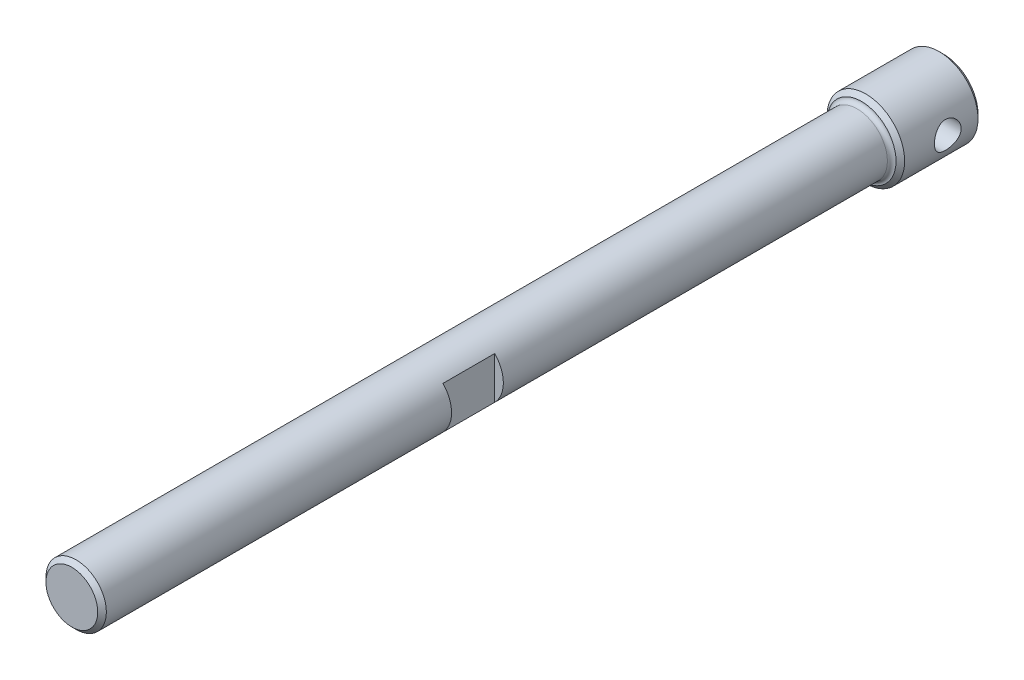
ISO-10303-21;
HEADER;
FILE_DESCRIPTION(('STEP AP214'),'2;1');
FILE_NAME('part.step','',(''),(''),'','','');
FILE_SCHEMA(('AUTOMOTIVE_DESIGN { 1 0 10303 214 1 1 1 1 }'));
ENDSEC;
DATA;
#1=APPLICATION_CONTEXT('core data for automotive mechanical design processes');
#2=APPLICATION_PROTOCOL_DEFINITION('international standard','automotive_design',2000,#1);
#3=PRODUCT_CONTEXT('',#1,'mechanical');
#4=PRODUCT('Part','Part','',(#3));
#5=PRODUCT_RELATED_PRODUCT_CATEGORY('part','',(#4));
#6=PRODUCT_DEFINITION_FORMATION('','',#4);
#7=PRODUCT_DEFINITION_CONTEXT('part definition',#1,'design');
#8=PRODUCT_DEFINITION('design','',#6,#7);
#9=PRODUCT_DEFINITION_SHAPE('','',#8);
#10=(LENGTH_UNIT() NAMED_UNIT(*) SI_UNIT(.MILLI.,.METRE.));
#11=(NAMED_UNIT(*) PLANE_ANGLE_UNIT() SI_UNIT($,.RADIAN.));
#12=(NAMED_UNIT(*) SI_UNIT($,.STERADIAN.) SOLID_ANGLE_UNIT());
#13=UNCERTAINTY_MEASURE_WITH_UNIT(LENGTH_MEASURE(1.E-05),#10,'distance_accuracy_value','');
#14=(GEOMETRIC_REPRESENTATION_CONTEXT(3) GLOBAL_UNCERTAINTY_ASSIGNED_CONTEXT((#13)) GLOBAL_UNIT_ASSIGNED_CONTEXT((#10,
#11,#12)) REPRESENTATION_CONTEXT('',''));
#15=CARTESIAN_POINT('',(0.,0.,0.));
#16=DIRECTION('',(0.,0.,1.));
#17=DIRECTION('',(1.,0.,0.));
#18=AXIS2_PLACEMENT_3D('',#15,#16,#17);
#19=CARTESIAN_POINT('',(0.,0.,19.));
#20=DIRECTION('',(0.,0.,-1.));
#21=DIRECTION('',(-1.,0.,0.));
#22=AXIS2_PLACEMENT_3D('',#19,#20,#21);
#23=CYLINDRICAL_SURFACE('',#22,9.);
#24=CARTESIAN_POINT('',(-9.,0.,11.1));
#25=CARTESIAN_POINT('',(-9.0000013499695,-0.1688224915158,11.1000019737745));
#26=CARTESIAN_POINT('',(-8.99520663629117,-0.337631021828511,11.0861647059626));
#27=CARTESIAN_POINT('',(-8.976553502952,-0.670256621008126,11.0313644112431));
#28=CARTESIAN_POINT('',(-8.96269474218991,-0.834073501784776,10.9904003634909));
#29=CARTESIAN_POINT('',(-8.92741476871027,-1.15187253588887,10.8829307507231));
#30=CARTESIAN_POINT('',(-8.90600671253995,-1.30587125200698,10.8164696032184));
#31=CARTESIAN_POINT('',(-8.85779948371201,-1.60053364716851,10.6600996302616));
#32=CARTESIAN_POINT('',(-8.83099913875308,-1.74119441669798,10.5701857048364));
#33=CARTESIAN_POINT('',(-8.77371476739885,-2.01034785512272,10.3660031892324));
#34=CARTESIAN_POINT('',(-8.74313823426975,-2.13828432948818,10.2510275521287));
#35=CARTESIAN_POINT('',(-8.68224229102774,-2.37349066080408,10.0014877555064));
#36=CARTESIAN_POINT('',(-8.65192294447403,-2.48075554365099,9.86691889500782));
#37=CARTESIAN_POINT('',(-8.59394178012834,-2.67483959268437,9.57689678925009));
#38=CARTESIAN_POINT('',(-8.56639182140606,-2.76091983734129,9.42092451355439));
#39=CARTESIAN_POINT('',(-8.51848371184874,-2.90538654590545,9.09561517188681));
#40=CARTESIAN_POINT('',(-8.49812319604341,-2.96378211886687,8.92628252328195));
#41=CARTESIAN_POINT('',(-8.46787709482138,-3.0491069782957,8.58540714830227));
#42=CARTESIAN_POINT('',(-8.45764395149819,-3.07708383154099,8.41415842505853));
#43=CARTESIAN_POINT('',(-8.44778574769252,-3.10405252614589,8.06911514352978));
#44=CARTESIAN_POINT('',(-8.44815714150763,-3.10305405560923,7.89532145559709));
#45=CARTESIAN_POINT('',(-8.45916271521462,-3.0729105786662,7.55921435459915));
#46=CARTESIAN_POINT('',(-8.46929077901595,-3.04515358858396,7.39675696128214));
#47=CARTESIAN_POINT('',(-8.49783702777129,-2.96455306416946,7.07896420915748));
#48=CARTESIAN_POINT('',(-8.51625626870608,-2.91170633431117,6.92362976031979));
#49=CARTESIAN_POINT('',(-8.55965538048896,-2.78155650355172,6.62142295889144));
#50=CARTESIAN_POINT('',(-8.58474076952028,-2.70385554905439,6.47473775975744));
#51=CARTESIAN_POINT('',(-8.63860379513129,-2.52647923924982,6.19605842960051));
#52=CARTESIAN_POINT('',(-8.66738255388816,-2.42679719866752,6.06406878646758));
#53=CARTESIAN_POINT('',(-8.72735868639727,-2.20170302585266,5.81075607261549));
#54=CARTESIAN_POINT('',(-8.75860125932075,-2.0751627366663,5.69044403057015));
#55=CARTESIAN_POINT('',(-8.81858149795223,-1.80332231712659,5.47247485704));
#56=CARTESIAN_POINT('',(-8.84731888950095,-1.65802013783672,5.37482020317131));
#57=CARTESIAN_POINT('',(-8.89947387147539,-1.35052584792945,5.20404941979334));
#58=CARTESIAN_POINT('',(-8.92282815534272,-1.18816252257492,5.13122090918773));
#59=CARTESIAN_POINT('',(-8.96112382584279,-0.852489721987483,5.01423056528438));
#60=CARTESIAN_POINT('',(-8.97606834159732,-0.679184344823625,4.97005806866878));
#61=CARTESIAN_POINT('',(-8.99533409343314,-0.335093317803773,4.91346358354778));
#62=CARTESIAN_POINT('',(-9.00011165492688,-0.164557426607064,4.89967670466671));
#63=CARTESIAN_POINT('',(-8.99988442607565,0.176435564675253,4.90033467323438));
#64=CARTESIAN_POINT('',(-8.99488141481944,0.34689267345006,4.91477438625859));
#65=CARTESIAN_POINT('',(-8.97595670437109,0.677315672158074,4.9704055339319));
#66=CARTESIAN_POINT('',(-8.96231927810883,0.837442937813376,5.01074484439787));
#67=CARTESIAN_POINT('',(-8.92778160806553,1.14858080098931,5.1159503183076));
#68=CARTESIAN_POINT('',(-8.90688042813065,1.29959022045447,5.18081964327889));
#69=CARTESIAN_POINT('',(-8.85921415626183,1.59279635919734,5.33519275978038));
#70=CARTESIAN_POINT('',(-8.83230485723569,1.73464102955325,5.4253193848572));
#71=CARTESIAN_POINT('',(-8.77565605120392,2.00162885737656,5.62692482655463));
#72=CARTESIAN_POINT('',(-8.74591563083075,2.12676659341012,5.73841054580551));
#73=CARTESIAN_POINT('',(-8.68511436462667,2.36313635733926,5.985979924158));
#74=CARTESIAN_POINT('',(-8.65405971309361,2.47339498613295,6.12299677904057));
#75=CARTESIAN_POINT('',(-8.59559822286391,2.66949341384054,6.41424436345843));
#76=CARTESIAN_POINT('',(-8.56819147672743,2.75533259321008,6.56847552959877));
#77=CARTESIAN_POINT('',(-8.52036689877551,2.89985728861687,6.89010214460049));
#78=CARTESIAN_POINT('',(-8.49994402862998,2.9585623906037,7.05748799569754));
#79=CARTESIAN_POINT('',(-8.46877286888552,3.04665590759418,7.40064520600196));
#80=CARTESIAN_POINT('',(-8.45801982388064,3.07605873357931,7.57641239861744));
#81=CARTESIAN_POINT('',(-8.4479707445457,3.10354357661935,7.9209858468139));
#82=CARTESIAN_POINT('',(-8.44807968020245,3.10325224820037,8.08964635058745));
#83=CARTESIAN_POINT('',(-8.45825706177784,3.07540278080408,8.42437897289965));
#84=CARTESIAN_POINT('',(-8.46832483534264,3.0478464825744,8.59045126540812));
#85=CARTESIAN_POINT('',(-8.49682822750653,2.9674327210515,8.91169003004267));
#86=CARTESIAN_POINT('',(-8.51507772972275,2.91513664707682,9.06701486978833));
#87=CARTESIAN_POINT('',(-8.55780872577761,2.78719165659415,9.36679940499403));
#88=CARTESIAN_POINT('',(-8.58229165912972,2.711537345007,9.51125658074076));
#89=CARTESIAN_POINT('',(-8.63613518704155,2.53496548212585,9.79241771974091));
#90=CARTESIAN_POINT('',(-8.66566842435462,2.43304537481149,9.92845875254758));
#91=CARTESIAN_POINT('',(-8.72559741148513,2.20849236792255,10.1820311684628));
#92=CARTESIAN_POINT('',(-8.75599341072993,2.08585342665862,10.2995571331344));
#93=CARTESIAN_POINT('',(-8.81578076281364,1.81706632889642,10.5178351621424));
#94=CARTESIAN_POINT('',(-8.84507387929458,1.67013823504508,10.6176573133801));
#95=CARTESIAN_POINT('',(-8.8979418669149,1.36060296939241,10.7910955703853));
#96=CARTESIAN_POINT('',(-8.9215177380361,1.19799854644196,10.8647162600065));
#97=CARTESIAN_POINT('',(-8.95982451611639,0.865400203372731,10.9818555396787));
#98=CARTESIAN_POINT('',(-8.97474112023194,0.695652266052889,11.0260094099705));
#99=CARTESIAN_POINT('',(-8.99482657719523,0.350596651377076,11.0850758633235));
#100=CARTESIAN_POINT('',(-8.99999859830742,0.175290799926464,11.0999979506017));
#101=CARTESIAN_POINT('',(-9.,0.,11.1));
#102=B_SPLINE_CURVE_WITH_KNOTS('',3,(#24,#25,#26,#27,#28,#29,#30,#31,#32,#33,#34,#35,#36,#37,
#38,#39,#40,#41,#42,#43,#44,#45,#46,#47,#48,#49,#50,#51,#52,#53,#54,#55,#56,#57,#58,#59,#60,#61,
#62,#63,#64,#65,#66,#67,#68,#69,#70,#71,#72,#73,#74,#75,#76,#77,#78,#79,#80,#81,#82,#83,#84,#85,
#86,#87,#88,#89,#90,#91,#92,#93,#94,#95,#96,#97,#98,#99,#100,#101),.UNSPECIFIED.,.T.,.F.,(4,2,2,
2,2,2,2,2,2,2,2,2,2,2,2,2,2,2,2,2,2,2,2,2,2,2,2,2,2,2,2,2,2,2,2,2,2,2,4),(0.,0.505822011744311,
1.01166305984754,1.5166268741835,2.02170058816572,2.54347627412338,3.06537735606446,
3.60349632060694,4.14143810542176,4.66020207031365,5.17879258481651,5.67185394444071,
6.16497811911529,6.66642814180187,7.16803088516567,7.6977190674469,8.22746514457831,
8.76315503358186,9.29864547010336,9.80954519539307,10.3203519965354,10.8151585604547,
11.3100289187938,11.8183777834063,12.3268912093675,12.8601576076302,13.3934375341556,
13.9263319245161,14.4589641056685,14.9624351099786,15.4658721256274,15.9583963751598,
16.4510344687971,16.9663482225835,17.4818125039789,18.0192752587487,18.556643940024,
19.0820169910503,19.6072191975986),.UNSPECIFIED.);
#103=CARTESIAN_POINT('',(-9.,0.,11.1));
#104=VERTEX_POINT('',#103);
#105=EDGE_CURVE('E74',#104,#104,#102,.T.);
#106=ORIENTED_EDGE('',*,*,#105,.T.);
#107=EDGE_LOOP('',(#106));
#108=FACE_BOUND('',#107,.T.);
#109=CARTESIAN_POINT('',(9.,0.,4.9));
#110=CARTESIAN_POINT('',(9.00000134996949,-0.168822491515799,4.89999802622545));
#111=CARTESIAN_POINT('',(8.99520663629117,-0.337631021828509,4.91383529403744));
#112=CARTESIAN_POINT('',(8.976553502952,-0.670256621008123,4.96863558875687));
#113=CARTESIAN_POINT('',(8.96269474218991,-0.834073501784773,5.00959963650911));
#114=CARTESIAN_POINT('',(8.92741476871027,-1.15187253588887,5.1170692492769));
#115=CARTESIAN_POINT('',(8.90600671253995,-1.30587125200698,5.18353039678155));
#116=CARTESIAN_POINT('',(8.85779948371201,-1.60053364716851,5.33990036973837));
#117=CARTESIAN_POINT('',(8.83099913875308,-1.74119441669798,5.42981429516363));
#118=CARTESIAN_POINT('',(8.77371476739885,-2.01034785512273,5.63399681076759));
#119=CARTESIAN_POINT('',(8.74313823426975,-2.13828432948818,5.74897244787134));
#120=CARTESIAN_POINT('',(8.68224229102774,-2.37349066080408,5.99851224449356));
#121=CARTESIAN_POINT('',(8.65192294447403,-2.48075554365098,6.13308110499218));
#122=CARTESIAN_POINT('',(8.59394178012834,-2.67483959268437,6.42310321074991));
#123=CARTESIAN_POINT('',(8.56639182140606,-2.76091983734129,6.57907548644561));
#124=CARTESIAN_POINT('',(8.51848371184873,-2.90538654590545,6.90438482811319));
#125=CARTESIAN_POINT('',(8.49812319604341,-2.96378211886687,7.07371747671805));
#126=CARTESIAN_POINT('',(8.46787709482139,-3.0491069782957,7.41459285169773));
#127=CARTESIAN_POINT('',(8.45764395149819,-3.07708383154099,7.58584157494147));
#128=CARTESIAN_POINT('',(8.44778574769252,-3.10405252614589,7.93088485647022));
#129=CARTESIAN_POINT('',(8.44815714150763,-3.10305405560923,8.10467854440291));
#130=CARTESIAN_POINT('',(8.45916271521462,-3.0729105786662,8.44078564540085));
#131=CARTESIAN_POINT('',(8.46929077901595,-3.04515358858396,8.60324303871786));
#132=CARTESIAN_POINT('',(8.49783702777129,-2.96455306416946,8.92103579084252));
#133=CARTESIAN_POINT('',(8.51625626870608,-2.91170633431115,9.07637023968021));
#134=CARTESIAN_POINT('',(8.55965538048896,-2.7815565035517,9.37857704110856));
#135=CARTESIAN_POINT('',(8.58474076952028,-2.70385554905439,9.52526224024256));
#136=CARTESIAN_POINT('',(8.63860379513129,-2.52647923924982,9.80394157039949));
#137=CARTESIAN_POINT('',(8.66738255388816,-2.42679719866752,9.93593121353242));
#138=CARTESIAN_POINT('',(8.72735868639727,-2.20170302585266,10.1892439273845));
#139=CARTESIAN_POINT('',(8.75860125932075,-2.07516273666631,10.3095559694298));
#140=CARTESIAN_POINT('',(8.81858149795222,-1.80332231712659,10.52752514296));
#141=CARTESIAN_POINT('',(8.84731888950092,-1.65802013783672,10.6251797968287));
#142=CARTESIAN_POINT('',(8.89947387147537,-1.35052584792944,10.7959505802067));
#143=CARTESIAN_POINT('',(8.92282815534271,-1.18816252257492,10.8687790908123));
#144=CARTESIAN_POINT('',(8.9611238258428,-0.852489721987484,10.9857694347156));
#145=CARTESIAN_POINT('',(8.97606834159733,-0.679184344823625,11.0299419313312));
#146=CARTESIAN_POINT('',(8.99533409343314,-0.335093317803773,11.0865364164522));
#147=CARTESIAN_POINT('',(9.00011165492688,-0.164557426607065,11.1003232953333));
#148=CARTESIAN_POINT('',(8.99988442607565,0.176435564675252,11.0996653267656));
#149=CARTESIAN_POINT('',(8.99488141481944,0.346892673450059,11.0852256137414));
#150=CARTESIAN_POINT('',(8.97595670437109,0.677315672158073,11.0295944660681));
#151=CARTESIAN_POINT('',(8.96231927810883,0.837442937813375,10.9892551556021));
#152=CARTESIAN_POINT('',(8.92778160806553,1.14858080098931,10.8840496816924));
#153=CARTESIAN_POINT('',(8.90688042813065,1.29959022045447,10.8191803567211));
#154=CARTESIAN_POINT('',(8.85921415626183,1.59279635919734,10.6648072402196));
#155=CARTESIAN_POINT('',(8.83230485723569,1.73464102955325,10.5746806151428));
#156=CARTESIAN_POINT('',(8.77565605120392,2.00162885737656,10.3730751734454));
#157=CARTESIAN_POINT('',(8.74591563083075,2.12676659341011,10.2615894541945));
#158=CARTESIAN_POINT('',(8.68511436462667,2.36313635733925,10.014020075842));
#159=CARTESIAN_POINT('',(8.65405971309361,2.47339498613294,9.87700322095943));
#160=CARTESIAN_POINT('',(8.59559822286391,2.66949341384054,9.58575563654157));
#161=CARTESIAN_POINT('',(8.56819147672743,2.75533259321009,9.43152447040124));
#162=CARTESIAN_POINT('',(8.52036689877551,2.89985728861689,9.10989785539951));
#163=CARTESIAN_POINT('',(8.49994402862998,2.9585623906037,8.94251200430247));
#164=CARTESIAN_POINT('',(8.46877286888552,3.04665590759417,8.59935479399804));
#165=CARTESIAN_POINT('',(8.45801982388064,3.07605873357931,8.42358760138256));
#166=CARTESIAN_POINT('',(8.4479707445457,3.10354357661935,8.0790141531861));
#167=CARTESIAN_POINT('',(8.44807968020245,3.10325224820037,7.91035364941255));
#168=CARTESIAN_POINT('',(8.45825706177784,3.07540278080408,7.57562102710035));
#169=CARTESIAN_POINT('',(8.46832483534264,3.0478464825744,7.40954873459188));
#170=CARTESIAN_POINT('',(8.49682822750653,2.9674327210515,7.08830996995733));
#171=CARTESIAN_POINT('',(8.51507772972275,2.91513664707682,6.93298513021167));
#172=CARTESIAN_POINT('',(8.55780872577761,2.78719165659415,6.63320059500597));
#173=CARTESIAN_POINT('',(8.58229165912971,2.711537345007,6.48874341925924));
#174=CARTESIAN_POINT('',(8.63613518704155,2.53496548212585,6.20758228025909));
#175=CARTESIAN_POINT('',(8.66566842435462,2.43304537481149,6.07154124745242));
#176=CARTESIAN_POINT('',(8.72559741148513,2.20849236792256,5.81796883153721));
#177=CARTESIAN_POINT('',(8.75599341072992,2.08585342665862,5.70044286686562));
#178=CARTESIAN_POINT('',(8.81578076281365,1.81706632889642,5.4821648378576));
#179=CARTESIAN_POINT('',(8.8450738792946,1.67013823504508,5.38234268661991));
#180=CARTESIAN_POINT('',(8.89794186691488,1.36060296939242,5.20890442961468));
#181=CARTESIAN_POINT('',(8.92151773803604,1.19799854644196,5.1352837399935));
#182=CARTESIAN_POINT('',(8.95982451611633,0.865400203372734,5.01814446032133));
#183=CARTESIAN_POINT('',(8.97474112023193,0.695652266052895,4.97399059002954));
#184=CARTESIAN_POINT('',(8.99482657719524,0.350596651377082,4.91492413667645));
#185=CARTESIAN_POINT('',(8.99999859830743,0.175290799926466,4.90000204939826));
#186=CARTESIAN_POINT('',(9.,0.,4.9));
#187=B_SPLINE_CURVE_WITH_KNOTS('',3,(#109,#110,#111,#112,#113,#114,#115,#116,#117,#118,#119,
#120,#121,#122,#123,#124,#125,#126,#127,#128,#129,#130,#131,#132,#133,#134,#135,#136,#137,#138,
#139,#140,#141,#142,#143,#144,#145,#146,#147,#148,#149,#150,#151,#152,#153,#154,#155,#156,#157,
#158,#159,#160,#161,#162,#163,#164,#165,#166,#167,#168,#169,#170,#171,#172,#173,#174,#175,#176,
#177,#178,#179,#180,#181,#182,#183,#184,#185,#186),.UNSPECIFIED.,.T.,.F.,(4,2,2,2,2,2,2,2,2,2,2,
2,2,2,2,2,2,2,2,2,2,2,2,2,2,2,2,2,2,2,2,2,2,2,2,2,2,2,4),(0.,0.505822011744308,1.01166305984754,
1.51662687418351,2.02170058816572,2.54347627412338,3.06537735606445,3.60349632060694,
4.14143810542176,4.66020207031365,5.17879258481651,5.67185394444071,6.16497811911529,
6.66642814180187,7.16803088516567,7.69771906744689,8.22746514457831,8.76315503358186,
9.29864547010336,9.80954519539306,10.3203519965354,10.8151585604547,11.3100289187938,
11.8183777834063,12.3268912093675,12.8601576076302,13.3934375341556,13.9263319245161,
14.4589641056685,14.9624351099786,15.4658721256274,15.9583963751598,16.4510344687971,
16.9663482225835,17.4818125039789,18.0192752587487,18.556643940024,19.0820169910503,
19.6072191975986),.UNSPECIFIED.);
#188=CARTESIAN_POINT('',(9.,0.,4.9));
#189=VERTEX_POINT('',#188);
#190=EDGE_CURVE('E80',#189,#189,#187,.T.);
#191=ORIENTED_EDGE('',*,*,#190,.T.);
#192=EDGE_LOOP('',(#191));
#193=FACE_BOUND('',#192,.T.);
#194=CARTESIAN_POINT('',(0.,0.,18.));
#195=DIRECTION('',(0.,0.,1.));
#196=DIRECTION('',(1.,0.,0.));
#197=AXIS2_PLACEMENT_3D('',#194,#195,#196);
#198=CIRCLE('',#197,9.);
#199=CARTESIAN_POINT('',(9.,0.,18.));
#200=VERTEX_POINT('',#199);
#201=EDGE_CURVE('E121',#200,#200,#198,.F.);
#202=ORIENTED_EDGE('',*,*,#201,.T.);
#203=EDGE_LOOP('',(#202));
#204=FACE_BOUND('',#203,.T.);
#205=CARTESIAN_POINT('',(0.,0.,1.00000000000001));
#206=DIRECTION('',(0.,0.,1.));
#207=DIRECTION('',(1.,0.,0.));
#208=AXIS2_PLACEMENT_3D('',#205,#206,#207);
#209=CIRCLE('',#208,9.);
#210=CARTESIAN_POINT('',(9.,0.,1.00000000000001));
#211=VERTEX_POINT('',#210);
#212=EDGE_CURVE('E127',#211,#211,#209,.T.);
#213=ORIENTED_EDGE('',*,*,#212,.T.);
#214=EDGE_LOOP('',(#213));
#215=FACE_BOUND('',#214,.T.);
#216=ADVANCED_FACE('F31',(#108,#193,#204,#215),#23,.T.);
#217=CARTESIAN_POINT('',(0.,0.,0.));
#218=DIRECTION('',(0.,0.,1.));
#219=DIRECTION('',(1.,0.,0.));
#220=AXIS2_PLACEMENT_3D('',#217,#218,#219);
#221=PLANE('',#220);
#222=CARTESIAN_POINT('',(0.,0.,0.));
#223=DIRECTION('',(0.,0.,1.));
#224=DIRECTION('',(1.,0.,0.));
#225=AXIS2_PLACEMENT_3D('',#222,#223,#224);
#226=CIRCLE('',#225,7.99999999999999);
#227=CARTESIAN_POINT('',(7.99999999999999,0.,0.));
#228=VERTEX_POINT('',#227);
#229=EDGE_CURVE('E119',#228,#228,#226,.F.);
#230=ORIENTED_EDGE('',*,*,#229,.T.);
#231=EDGE_LOOP('',(#230));
#232=FACE_BOUND('',#231,.T.);
#233=ADVANCED_FACE('F110',(#232),#221,.F.);
#234=CARTESIAN_POINT('',(0.,0.,202.));
#235=DIRECTION('',(0.,0.,-1.));
#236=DIRECTION('',(-1.,0.,0.));
#237=AXIS2_PLACEMENT_3D('',#234,#235,#236);
#238=CYLINDRICAL_SURFACE('',#237,7.);
#239=DIRECTION('',(0.,0.,-1.));
#240=VECTOR('',#239,1.);
#241=CARTESIAN_POINT('',(5.00000000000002,4.89897948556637,202.));
#242=LINE('',#241,#240);
#243=CARTESIAN_POINT('',(5.,4.89897948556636,121.));
#244=VERTEX_POINT('',#243);
#245=CARTESIAN_POINT('',(5.00000000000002,4.89897948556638,109.));
#246=VERTEX_POINT('',#245);
#247=EDGE_CURVE('E39',#244,#246,#242,.T.);
#248=ORIENTED_EDGE('',*,*,#247,.T.);
#249=CARTESIAN_POINT('',(0.,0.,109.));
#250=DIRECTION('',(0.,0.,-1.));
#251=DIRECTION('',(-1.,0.,0.));
#252=AXIS2_PLACEMENT_3D('',#249,#250,#251);
#253=CIRCLE('',#252,7.);
#254=CARTESIAN_POINT('',(5.00000000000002,-4.89897948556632,109.));
#255=VERTEX_POINT('',#254);
#256=EDGE_CURVE('E11',#246,#255,#253,.T.);
#257=ORIENTED_EDGE('',*,*,#256,.T.);
#258=DIRECTION('',(0.,0.,-1.));
#259=VECTOR('',#258,1.);
#260=CARTESIAN_POINT('',(5.00000000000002,-4.89897948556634,202.));
#261=LINE('',#260,#259);
#262=CARTESIAN_POINT('',(5.,-4.89897948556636,121.));
#263=VERTEX_POINT('',#262);
#264=EDGE_CURVE('E52',#255,#263,#261,.F.);
#265=ORIENTED_EDGE('',*,*,#264,.T.);
#266=CARTESIAN_POINT('',(0.,0.,121.));
#267=DIRECTION('',(0.,0.,1.));
#268=DIRECTION('',(1.,0.,0.));
#269=AXIS2_PLACEMENT_3D('',#266,#267,#268);
#270=CIRCLE('',#269,7.);
#271=EDGE_CURVE('E59',#263,#244,#270,.T.);
#272=ORIENTED_EDGE('',*,*,#271,.T.);
#273=EDGE_LOOP('',(#248,#257,#265,#272));
#274=FACE_BOUND('',#273,.T.);
#275=CARTESIAN_POINT('',(0.,0.,20.));
#276=DIRECTION('',(0.,0.,1.));
#277=DIRECTION('',(1.,0.,0.));
#278=AXIS2_PLACEMENT_3D('',#275,#276,#277);
#279=CIRCLE('',#278,7.);
#280=CARTESIAN_POINT('',(7.,0.,20.));
#281=VERTEX_POINT('',#280);
#282=EDGE_CURVE('E63',#281,#281,#279,.T.);
#283=ORIENTED_EDGE('',*,*,#282,.T.);
#284=EDGE_LOOP('',(#283));
#285=FACE_BOUND('',#284,.T.);
#286=CARTESIAN_POINT('',(0.,0.,201.));
#287=DIRECTION('',(0.,0.,1.));
#288=DIRECTION('',(1.,0.,0.));
#289=AXIS2_PLACEMENT_3D('',#286,#287,#288);
#290=CIRCLE('',#289,7.);
#291=CARTESIAN_POINT('',(7.,0.,201.));
#292=VERTEX_POINT('',#291);
#293=EDGE_CURVE('E124',#292,#292,#290,.F.);
#294=ORIENTED_EDGE('',*,*,#293,.T.);
#295=EDGE_LOOP('',(#294));
#296=FACE_BOUND('',#295,.T.);
#297=ADVANCED_FACE('F68',(#274,#285,#296),#238,.T.);
#298=CARTESIAN_POINT('',(0.,0.,202.));
#299=DIRECTION('',(0.,0.,1.));
#300=DIRECTION('',(1.,0.,0.));
#301=AXIS2_PLACEMENT_3D('',#298,#299,#300);
#302=PLANE('',#301);
#303=CARTESIAN_POINT('',(0.,0.,202.));
#304=DIRECTION('',(0.,0.,1.));
#305=DIRECTION('',(1.,0.,0.));
#306=AXIS2_PLACEMENT_3D('',#303,#304,#305);
#307=CIRCLE('',#306,5.99999999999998);
#308=CARTESIAN_POINT('',(5.99999999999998,0.,202.));
#309=VERTEX_POINT('',#308);
#310=EDGE_CURVE('E120',#309,#309,#307,.T.);
#311=ORIENTED_EDGE('',*,*,#310,.T.);
#312=EDGE_LOOP('',(#311));
#313=FACE_BOUND('',#312,.T.);
#314=ADVANCED_FACE('F104',(#313),#302,.T.);
#315=CARTESIAN_POINT('',(0.,0.,19.));
#316=DIRECTION('',(0.,0.,-1.));
#317=DIRECTION('',(-1.,0.,0.));
#318=AXIS2_PLACEMENT_3D('',#315,#316,#317);
#319=CONICAL_SURFACE('',#318,7.99999999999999,0.785398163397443);
#320=ORIENTED_EDGE('',*,*,#201,.F.);
#321=EDGE_LOOP('',(#320));
#322=FACE_BOUND('',#321,.T.);
#323=CARTESIAN_POINT('',(0.,0.,19.));
#324=DIRECTION('',(0.,0.,1.));
#325=DIRECTION('',(1.,0.,0.));
#326=AXIS2_PLACEMENT_3D('',#323,#324,#325);
#327=CIRCLE('',#326,7.99999999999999);
#328=CARTESIAN_POINT('',(7.99999999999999,0.,19.));
#329=VERTEX_POINT('',#328);
#330=EDGE_CURVE('E144',#329,#329,#327,.T.);
#331=ORIENTED_EDGE('',*,*,#330,.F.);
#332=EDGE_LOOP('',(#331));
#333=FACE_BOUND('',#332,.T.);
#334=ADVANCED_FACE('F100',(#322,#333),#319,.T.);
#335=CARTESIAN_POINT('',(0.,0.,1.00000000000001));
#336=DIRECTION('',(0.,0.,1.));
#337=DIRECTION('',(1.,0.,0.));
#338=AXIS2_PLACEMENT_3D('',#335,#336,#337);
#339=CONICAL_SURFACE('',#338,9.,0.785398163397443);
#340=ORIENTED_EDGE('',*,*,#229,.F.);
#341=EDGE_LOOP('',(#340));
#342=FACE_BOUND('',#341,.T.);
#343=ORIENTED_EDGE('',*,*,#212,.F.);
#344=EDGE_LOOP('',(#343));
#345=FACE_BOUND('',#344,.T.);
#346=ADVANCED_FACE('F96',(#342,#345),#339,.T.);
#347=CARTESIAN_POINT('',(0.,0.,202.));
#348=DIRECTION('',(0.,0.,-1.));
#349=DIRECTION('',(-1.,0.,0.));
#350=AXIS2_PLACEMENT_3D('',#347,#348,#349);
#351=CONICAL_SURFACE('',#350,5.99999999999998,0.785398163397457);
#352=ORIENTED_EDGE('',*,*,#293,.F.);
#353=EDGE_LOOP('',(#352));
#354=FACE_BOUND('',#353,.T.);
#355=ORIENTED_EDGE('',*,*,#310,.F.);
#356=EDGE_LOOP('',(#355));
#357=FACE_BOUND('',#356,.T.);
#358=ADVANCED_FACE('F90',(#354,#357),#351,.T.);
#359=CARTESIAN_POINT('',(-9.,0.,8.));
#360=DIRECTION('',(1.,0.,0.));
#361=DIRECTION('',(0.,0.,-1.));
#362=AXIS2_PLACEMENT_3D('',#359,#360,#361);
#363=CYLINDRICAL_SURFACE('',#362,3.1);
#364=ORIENTED_EDGE('',*,*,#190,.F.);
#365=EDGE_LOOP('',(#364));
#366=FACE_BOUND('',#365,.T.);
#367=ORIENTED_EDGE('',*,*,#105,.F.);
#368=EDGE_LOOP('',(#367));
#369=FACE_BOUND('',#368,.T.);
#370=ADVANCED_FACE('F84',(#366,#369),#363,.F.);
#371=CARTESIAN_POINT('',(0.,0.,20.));
#372=DIRECTION('',(0.,0.,1.));
#373=DIRECTION('',(1.,0.,0.));
#374=AXIS2_PLACEMENT_3D('',#371,#372,#373);
#375=TOROIDAL_SURFACE('',#374,8.,1.);
#376=ORIENTED_EDGE('',*,*,#330,.T.);
#377=EDGE_LOOP('',(#376));
#378=FACE_BOUND('',#377,.T.);
#379=ORIENTED_EDGE('',*,*,#282,.F.);
#380=EDGE_LOOP('',(#379));
#381=FACE_BOUND('',#380,.T.);
#382=ADVANCED_FACE('F89',(#378,#381),#375,.F.);
#383=CARTESIAN_POINT('',(19.9999999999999,254.497053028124,109.));
#384=DIRECTION('',(0.,0.,-1.));
#385=DIRECTION('',(-1.,0.,0.));
#386=AXIS2_PLACEMENT_3D('',#383,#384,#385);
#387=PLANE('',#386);
#388=ORIENTED_EDGE('',*,*,#256,.F.);
#389=DIRECTION('',(0.,-1.,0.));
#390=VECTOR('',#389,1.);
#391=CARTESIAN_POINT('',(5.00000000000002,254.497053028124,109.));
#392=LINE('',#391,#390);
#393=EDGE_CURVE('E66',#246,#255,#392,.T.);
#394=ORIENTED_EDGE('',*,*,#393,.T.);
#395=EDGE_LOOP('',(#388,#394));
#396=FACE_BOUND('',#395,.T.);
#397=ADVANCED_FACE('F149',(#396),#387,.F.);
#398=CARTESIAN_POINT('',(5.00000000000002,254.497053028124,121.));
#399=DIRECTION('',(-1.,0.,0.));
#400=DIRECTION('',(0.,0.,1.));
#401=AXIS2_PLACEMENT_3D('',#398,#399,#400);
#402=PLANE('',#401);
#403=ORIENTED_EDGE('',*,*,#247,.F.);
#404=DIRECTION('',(0.,-1.,0.));
#405=VECTOR('',#404,1.);
#406=CARTESIAN_POINT('',(5.00000000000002,254.497053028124,121.));
#407=LINE('',#406,#405);
#408=EDGE_CURVE('E45',#244,#263,#407,.T.);
#409=ORIENTED_EDGE('',*,*,#408,.T.);
#410=ORIENTED_EDGE('',*,*,#264,.F.);
#411=ORIENTED_EDGE('',*,*,#393,.F.);
#412=EDGE_LOOP('',(#403,#409,#410,#411));
#413=FACE_BOUND('',#412,.T.);
#414=ADVANCED_FACE('F65',(#413),#402,.F.);
#415=CARTESIAN_POINT('',(19.9999999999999,254.497053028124,121.));
#416=DIRECTION('',(0.,0.,1.));
#417=DIRECTION('',(1.,0.,0.));
#418=AXIS2_PLACEMENT_3D('',#415,#416,#417);
#419=PLANE('',#418);
#420=ORIENTED_EDGE('',*,*,#271,.F.);
#421=ORIENTED_EDGE('',*,*,#408,.F.);
#422=EDGE_LOOP('',(#420,#421));
#423=FACE_BOUND('',#422,.T.);
#424=ADVANCED_FACE('F60',(#423),#419,.F.);
#425=CLOSED_SHELL('',(#216,#233,#297,#314,#334,#346,#358,#370,#382,#397,#414,#424));
#426=MANIFOLD_SOLID_BREP('B2',#425);
#427=ADVANCED_BREP_SHAPE_REPRESENTATION('',(#18,#426),#14);
#428=SHAPE_DEFINITION_REPRESENTATION(#9,#427);
ENDSEC;
END-ISO-10303-21;
